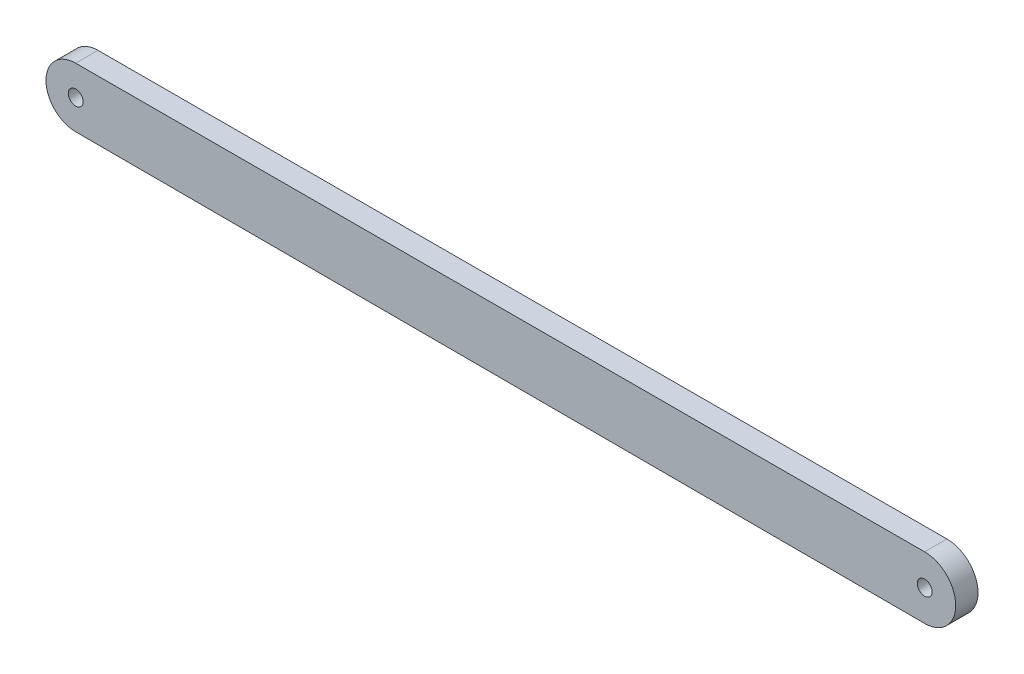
ISO-10303-21;
HEADER;
FILE_DESCRIPTION(('STEP AP214'),'2;1');
FILE_NAME('part.step','',(''),(''),'','','');
FILE_SCHEMA(('AUTOMOTIVE_DESIGN { 1 0 10303 214 1 1 1 1 }'));
ENDSEC;
DATA;
#1=APPLICATION_CONTEXT('core data for automotive mechanical design processes');
#2=APPLICATION_PROTOCOL_DEFINITION('international standard','automotive_design',2000,#1);
#3=PRODUCT_CONTEXT('',#1,'mechanical');
#4=PRODUCT('Part','Part','',(#3));
#5=PRODUCT_RELATED_PRODUCT_CATEGORY('part','',(#4));
#6=PRODUCT_DEFINITION_FORMATION('','',#4);
#7=PRODUCT_DEFINITION_CONTEXT('part definition',#1,'design');
#8=PRODUCT_DEFINITION('design','',#6,#7);
#9=PRODUCT_DEFINITION_SHAPE('','',#8);
#10=(LENGTH_UNIT() NAMED_UNIT(*) SI_UNIT(.MILLI.,.METRE.));
#11=(NAMED_UNIT(*) PLANE_ANGLE_UNIT() SI_UNIT($,.RADIAN.));
#12=(NAMED_UNIT(*) SI_UNIT($,.STERADIAN.) SOLID_ANGLE_UNIT());
#13=UNCERTAINTY_MEASURE_WITH_UNIT(LENGTH_MEASURE(1.E-05),#10,'distance_accuracy_value','');
#14=(GEOMETRIC_REPRESENTATION_CONTEXT(3) GLOBAL_UNCERTAINTY_ASSIGNED_CONTEXT((#13)) GLOBAL_UNIT_ASSIGNED_CONTEXT((#10,
#11,#12)) REPRESENTATION_CONTEXT('',''));
#15=CARTESIAN_POINT('',(0.,0.,0.));
#16=DIRECTION('',(0.,0.,1.));
#17=DIRECTION('',(1.,0.,0.));
#18=AXIS2_PLACEMENT_3D('',#15,#16,#17);
#19=CARTESIAN_POINT('',(0.,0.,3.));
#20=DIRECTION('',(0.,0.,-1.));
#21=DIRECTION('',(-1.,0.,0.));
#22=AXIS2_PLACEMENT_3D('',#19,#20,#21);
#23=PLANE('',#22);
#24=CARTESIAN_POINT('',(0.,0.,3.));
#25=DIRECTION('',(0.,0.,1.));
#26=DIRECTION('',(-1.,0.,0.));
#27=AXIS2_PLACEMENT_3D('',#24,#25,#26);
#28=CIRCLE('',#27,4.);
#29=CARTESIAN_POINT('',(-0.00612423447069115,3.99999531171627,3.));
#30=VERTEX_POINT('',#29);
#31=CARTESIAN_POINT('',(-0.00612423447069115,-3.99999531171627,3.));
#32=VERTEX_POINT('',#31);
#33=EDGE_CURVE('E91',#30,#32,#28,.T.);
#34=ORIENTED_EDGE('',*,*,#33,.T.);
#35=DIRECTION('',(0.999998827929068,-0.00153105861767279,0.));
#36=VECTOR('',#35,1.);
#37=CARTESIAN_POINT('',(114.293607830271,-4.17499510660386,3.));
#38=LINE('',#37,#36);
#39=CARTESIAN_POINT('',(114.293607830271,-4.17499510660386,3.));
#40=VERTEX_POINT('',#39);
#41=EDGE_CURVE('E86',#32,#40,#38,.T.);
#42=ORIENTED_EDGE('',*,*,#41,.T.);
#43=CARTESIAN_POINT('',(114.3,0.,3.));
#44=DIRECTION('',(0.,0.,1.));
#45=DIRECTION('',(1.,0.,0.));
#46=AXIS2_PLACEMENT_3D('',#43,#44,#45);
#47=CIRCLE('',#46,4.175);
#48=CARTESIAN_POINT('',(114.293607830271,4.17499510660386,3.));
#49=VERTEX_POINT('',#48);
#50=EDGE_CURVE('E89',#40,#49,#47,.T.);
#51=ORIENTED_EDGE('',*,*,#50,.T.);
#52=DIRECTION('',(-0.999998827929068,-0.00153105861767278,0.));
#53=VECTOR('',#52,1.);
#54=CARTESIAN_POINT('',(-0.00612423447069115,3.99999531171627,3.));
#55=LINE('',#54,#53);
#56=EDGE_CURVE('E56',#49,#30,#55,.T.);
#57=ORIENTED_EDGE('',*,*,#56,.T.);
#58=EDGE_LOOP('',(#34,#42,#51,#57));
#59=FACE_BOUND('',#58,.T.);
#60=CARTESIAN_POINT('',(0.,0.,3.));
#61=DIRECTION('',(0.,0.,1.));
#62=DIRECTION('',(1.,0.,0.));
#63=AXIS2_PLACEMENT_3D('',#60,#61,#62);
#64=CIRCLE('',#63,1.);
#65=CARTESIAN_POINT('',(1.,0.,3.));
#66=VERTEX_POINT('',#65);
#67=EDGE_CURVE('E106',#66,#66,#64,.T.);
#68=ORIENTED_EDGE('',*,*,#67,.F.);
#69=EDGE_LOOP('',(#68));
#70=FACE_BOUND('',#69,.T.);
#71=CARTESIAN_POINT('',(114.3,0.,3.));
#72=DIRECTION('',(0.,0.,1.));
#73=DIRECTION('',(1.,0.,0.));
#74=AXIS2_PLACEMENT_3D('',#71,#72,#73);
#75=CIRCLE('',#74,0.999999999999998);
#76=CARTESIAN_POINT('',(115.3,0.,3.));
#77=VERTEX_POINT('',#76);
#78=EDGE_CURVE('E121',#77,#77,#75,.T.);
#79=ORIENTED_EDGE('',*,*,#78,.F.);
#80=EDGE_LOOP('',(#79));
#81=FACE_BOUND('',#80,.T.);
#82=ADVANCED_FACE('F39',(#59,#70,#81),#23,.F.);
#83=CARTESIAN_POINT('',(0.,0.,0.));
#84=DIRECTION('',(0.,0.,-1.));
#85=DIRECTION('',(-1.,0.,0.));
#86=AXIS2_PLACEMENT_3D('',#83,#84,#85);
#87=PLANE('',#86);
#88=CARTESIAN_POINT('',(0.,0.,0.));
#89=DIRECTION('',(0.,0.,1.));
#90=DIRECTION('',(1.,0.,0.));
#91=AXIS2_PLACEMENT_3D('',#88,#89,#90);
#92=CIRCLE('',#91,1.);
#93=CARTESIAN_POINT('',(1.,0.,0.));
#94=VERTEX_POINT('',#93);
#95=EDGE_CURVE('E118',#94,#94,#92,.T.);
#96=ORIENTED_EDGE('',*,*,#95,.T.);
#97=EDGE_LOOP('',(#96));
#98=FACE_BOUND('',#97,.T.);
#99=CARTESIAN_POINT('',(0.,0.,0.));
#100=DIRECTION('',(0.,0.,1.));
#101=DIRECTION('',(-1.,0.,0.));
#102=AXIS2_PLACEMENT_3D('',#99,#100,#101);
#103=CIRCLE('',#102,4.);
#104=CARTESIAN_POINT('',(-0.00612423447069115,3.99999531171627,0.));
#105=VERTEX_POINT('',#104);
#106=CARTESIAN_POINT('',(-0.00612423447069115,-3.99999531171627,0.));
#107=VERTEX_POINT('',#106);
#108=EDGE_CURVE('E103',#105,#107,#103,.T.);
#109=ORIENTED_EDGE('',*,*,#108,.F.);
#110=DIRECTION('',(-0.999998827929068,-0.00153105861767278,0.));
#111=VECTOR('',#110,1.);
#112=CARTESIAN_POINT('',(-0.00612423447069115,3.99999531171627,0.));
#113=LINE('',#112,#111);
#114=CARTESIAN_POINT('',(114.293607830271,4.17499510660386,0.));
#115=VERTEX_POINT('',#114);
#116=EDGE_CURVE('E79',#115,#105,#113,.T.);
#117=ORIENTED_EDGE('',*,*,#116,.F.);
#118=CARTESIAN_POINT('',(114.3,0.,0.));
#119=DIRECTION('',(0.,0.,1.));
#120=DIRECTION('',(1.,0.,0.));
#121=AXIS2_PLACEMENT_3D('',#118,#119,#120);
#122=CIRCLE('',#121,4.175);
#123=CARTESIAN_POINT('',(114.293607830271,-4.17499510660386,0.));
#124=VERTEX_POINT('',#123);
#125=EDGE_CURVE('E73',#124,#115,#122,.T.);
#126=ORIENTED_EDGE('',*,*,#125,.F.);
#127=DIRECTION('',(0.999998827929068,-0.00153105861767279,0.));
#128=VECTOR('',#127,1.);
#129=CARTESIAN_POINT('',(114.293607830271,-4.17499510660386,0.));
#130=LINE('',#129,#128);
#131=EDGE_CURVE('E95',#107,#124,#130,.T.);
#132=ORIENTED_EDGE('',*,*,#131,.F.);
#133=EDGE_LOOP('',(#109,#117,#126,#132));
#134=FACE_BOUND('',#133,.T.);
#135=CARTESIAN_POINT('',(114.3,0.,0.));
#136=DIRECTION('',(0.,0.,1.));
#137=DIRECTION('',(1.,0.,0.));
#138=AXIS2_PLACEMENT_3D('',#135,#136,#137);
#139=CIRCLE('',#138,0.999999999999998);
#140=CARTESIAN_POINT('',(115.3,0.,0.));
#141=VERTEX_POINT('',#140);
#142=EDGE_CURVE('E124',#141,#141,#139,.T.);
#143=ORIENTED_EDGE('',*,*,#142,.T.);
#144=EDGE_LOOP('',(#143));
#145=FACE_BOUND('',#144,.T.);
#146=ADVANCED_FACE('F114',(#98,#134,#145),#87,.T.);
#147=CARTESIAN_POINT('',(0.,0.,3.));
#148=DIRECTION('',(0.,0.,-1.));
#149=DIRECTION('',(-1.,0.,0.));
#150=AXIS2_PLACEMENT_3D('',#147,#148,#149);
#151=CYLINDRICAL_SURFACE('',#150,4.);
#152=ORIENTED_EDGE('',*,*,#108,.T.);
#153=DIRECTION('',(0.,0.,-1.));
#154=VECTOR('',#153,1.);
#155=CARTESIAN_POINT('',(-0.00612423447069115,-3.99999531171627,3.));
#156=LINE('',#155,#154);
#157=EDGE_CURVE('E11',#32,#107,#156,.T.);
#158=ORIENTED_EDGE('',*,*,#157,.F.);
#159=ORIENTED_EDGE('',*,*,#33,.F.);
#160=DIRECTION('',(0.,0.,-1.));
#161=VECTOR('',#160,1.);
#162=CARTESIAN_POINT('',(-0.00612423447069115,3.99999531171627,3.));
#163=LINE('',#162,#161);
#164=EDGE_CURVE('E99',#30,#105,#163,.T.);
#165=ORIENTED_EDGE('',*,*,#164,.T.);
#166=EDGE_LOOP('',(#152,#158,#159,#165));
#167=FACE_BOUND('',#166,.T.);
#168=ADVANCED_FACE('F41',(#167),#151,.T.);
#169=CARTESIAN_POINT('',(114.293607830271,-4.17499510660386,3.));
#170=DIRECTION('',(0.00153105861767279,0.999998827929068,0.));
#171=DIRECTION('',(-0.999998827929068,0.00153105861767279,0.));
#172=AXIS2_PLACEMENT_3D('',#169,#170,#171);
#173=PLANE('',#172);
#174=ORIENTED_EDGE('',*,*,#131,.T.);
#175=DIRECTION('',(0.,0.,-1.));
#176=VECTOR('',#175,1.);
#177=CARTESIAN_POINT('',(114.293607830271,-4.17499510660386,3.));
#178=LINE('',#177,#176);
#179=EDGE_CURVE('E48',#40,#124,#178,.T.);
#180=ORIENTED_EDGE('',*,*,#179,.F.);
#181=ORIENTED_EDGE('',*,*,#41,.F.);
#182=ORIENTED_EDGE('',*,*,#157,.T.);
#183=EDGE_LOOP('',(#174,#180,#181,#182));
#184=FACE_BOUND('',#183,.T.);
#185=ADVANCED_FACE('F94',(#184),#173,.F.);
#186=CARTESIAN_POINT('',(114.3,0.,3.));
#187=DIRECTION('',(0.,0.,-1.));
#188=DIRECTION('',(-1.,0.,0.));
#189=AXIS2_PLACEMENT_3D('',#186,#187,#188);
#190=CYLINDRICAL_SURFACE('',#189,4.175);
#191=ORIENTED_EDGE('',*,*,#125,.T.);
#192=DIRECTION('',(0.,0.,-1.));
#193=VECTOR('',#192,1.);
#194=CARTESIAN_POINT('',(114.293607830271,4.17499510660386,3.));
#195=LINE('',#194,#193);
#196=EDGE_CURVE('E96',#49,#115,#195,.T.);
#197=ORIENTED_EDGE('',*,*,#196,.F.);
#198=ORIENTED_EDGE('',*,*,#50,.F.);
#199=ORIENTED_EDGE('',*,*,#179,.T.);
#200=EDGE_LOOP('',(#191,#197,#198,#199));
#201=FACE_BOUND('',#200,.T.);
#202=ADVANCED_FACE('F97',(#201),#190,.T.);
#203=CARTESIAN_POINT('',(-0.00612423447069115,3.99999531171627,3.));
#204=DIRECTION('',(0.00153105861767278,-0.999998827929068,0.));
#205=DIRECTION('',(0.999998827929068,0.00153105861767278,0.));
#206=AXIS2_PLACEMENT_3D('',#203,#204,#205);
#207=PLANE('',#206);
#208=ORIENTED_EDGE('',*,*,#116,.T.);
#209=ORIENTED_EDGE('',*,*,#164,.F.);
#210=ORIENTED_EDGE('',*,*,#56,.F.);
#211=ORIENTED_EDGE('',*,*,#196,.T.);
#212=EDGE_LOOP('',(#208,#209,#210,#211));
#213=FACE_BOUND('',#212,.T.);
#214=ADVANCED_FACE('F111',(#213),#207,.F.);
#215=CARTESIAN_POINT('',(0.,0.,3.));
#216=DIRECTION('',(0.,0.,-1.));
#217=DIRECTION('',(-1.,0.,0.));
#218=AXIS2_PLACEMENT_3D('',#215,#216,#217);
#219=CYLINDRICAL_SURFACE('',#218,1.);
#220=ORIENTED_EDGE('',*,*,#67,.T.);
#221=EDGE_LOOP('',(#220));
#222=FACE_BOUND('',#221,.T.);
#223=ORIENTED_EDGE('',*,*,#95,.F.);
#224=EDGE_LOOP('',(#223));
#225=FACE_BOUND('',#224,.T.);
#226=ADVANCED_FACE('F141',(#222,#225),#219,.F.);
#227=CARTESIAN_POINT('',(114.3,0.,3.));
#228=DIRECTION('',(0.,0.,-1.));
#229=DIRECTION('',(-1.,0.,0.));
#230=AXIS2_PLACEMENT_3D('',#227,#228,#229);
#231=CYLINDRICAL_SURFACE('',#230,0.999999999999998);
#232=ORIENTED_EDGE('',*,*,#78,.T.);
#233=EDGE_LOOP('',(#232));
#234=FACE_BOUND('',#233,.T.);
#235=ORIENTED_EDGE('',*,*,#142,.F.);
#236=EDGE_LOOP('',(#235));
#237=FACE_BOUND('',#236,.T.);
#238=ADVANCED_FACE('F130',(#234,#237),#231,.F.);
#239=CLOSED_SHELL('',(#82,#146,#168,#185,#202,#214,#226,#238));
#240=MANIFOLD_SOLID_BREP('B2',#239);
#241=ADVANCED_BREP_SHAPE_REPRESENTATION('',(#18,#240),#14);
#242=SHAPE_DEFINITION_REPRESENTATION(#9,#241);
ENDSEC;
END-ISO-10303-21;
